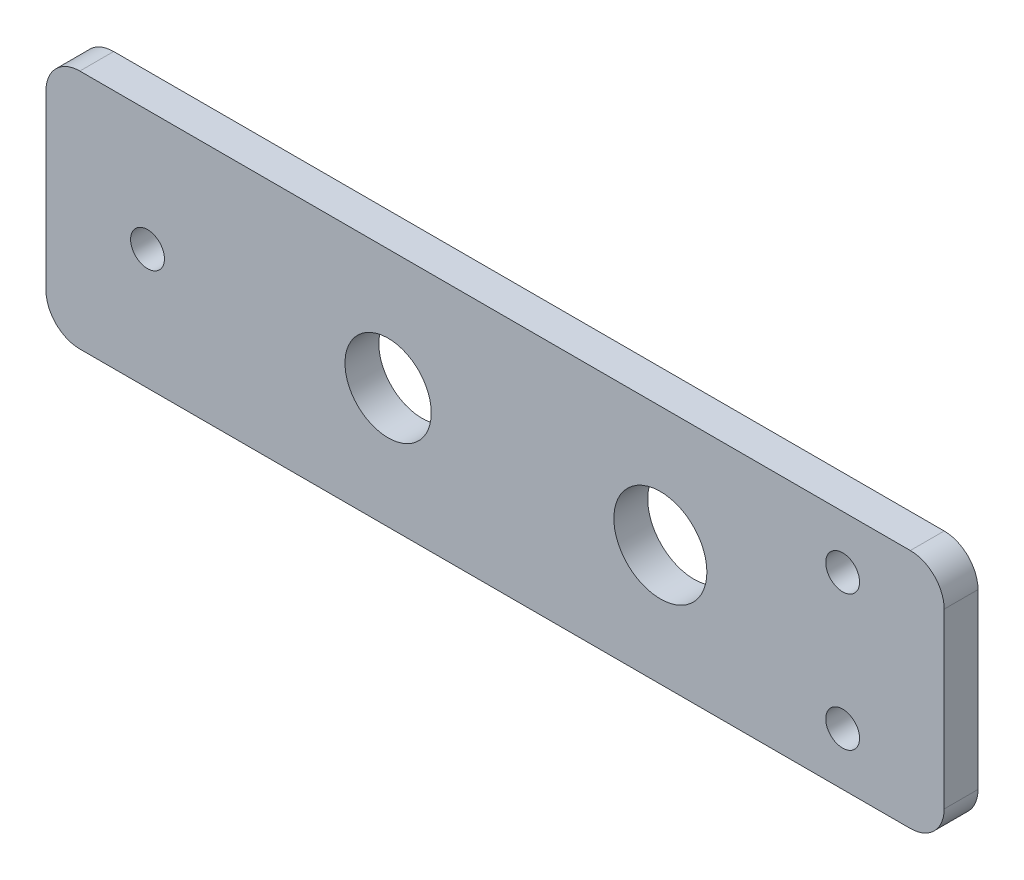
ISO-10303-21;
HEADER;
FILE_DESCRIPTION(('STEP AP214'),'2;1');
FILE_NAME('part.step','',(''),(''),'','','');
FILE_SCHEMA(('AUTOMOTIVE_DESIGN { 1 0 10303 214 1 1 1 1 }'));
ENDSEC;
DATA;
#1=APPLICATION_CONTEXT('core data for automotive mechanical design processes');
#2=APPLICATION_PROTOCOL_DEFINITION('international standard','automotive_design',2000,#1);
#3=PRODUCT_CONTEXT('',#1,'mechanical');
#4=PRODUCT('Part','Part','',(#3));
#5=PRODUCT_RELATED_PRODUCT_CATEGORY('part','',(#4));
#6=PRODUCT_DEFINITION_FORMATION('','',#4);
#7=PRODUCT_DEFINITION_CONTEXT('part definition',#1,'design');
#8=PRODUCT_DEFINITION('design','',#6,#7);
#9=PRODUCT_DEFINITION_SHAPE('','',#8);
#10=(LENGTH_UNIT() NAMED_UNIT(*) SI_UNIT(.MILLI.,.METRE.));
#11=(NAMED_UNIT(*) PLANE_ANGLE_UNIT() SI_UNIT($,.RADIAN.));
#12=(NAMED_UNIT(*) SI_UNIT($,.STERADIAN.) SOLID_ANGLE_UNIT());
#13=UNCERTAINTY_MEASURE_WITH_UNIT(LENGTH_MEASURE(1.E-05),#10,'distance_accuracy_value','');
#14=(GEOMETRIC_REPRESENTATION_CONTEXT(3) GLOBAL_UNCERTAINTY_ASSIGNED_CONTEXT((#13)) GLOBAL_UNIT_ASSIGNED_CONTEXT((#10,
#11,#12)) REPRESENTATION_CONTEXT('',''));
#15=CARTESIAN_POINT('',(0.,0.,0.));
#16=DIRECTION('',(0.,0.,1.));
#17=DIRECTION('',(1.,0.,0.));
#18=AXIS2_PLACEMENT_3D('',#15,#16,#17);
#19=CARTESIAN_POINT('',(0.,0.,2.54));
#20=DIRECTION('',(0.,0.,-1.));
#21=DIRECTION('',(-1.,0.,0.));
#22=AXIS2_PLACEMENT_3D('',#19,#20,#21);
#23=PLANE('',#22);
#24=DIRECTION('',(1.,0.,0.));
#25=VECTOR('',#24,1.);
#26=CARTESIAN_POINT('',(21.3032407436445,-9.03586527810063,2.54));
#27=LINE('',#26,#25);
#28=CARTESIAN_POINT('',(-43.577750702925,-9.03586527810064,2.54));
#29=VERTEX_POINT('',#28);
#30=CARTESIAN_POINT('',(18.7632407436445,-9.03586527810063,2.54));
#31=VERTEX_POINT('',#30);
#32=EDGE_CURVE('E135',#29,#31,#27,.T.);
#33=ORIENTED_EDGE('',*,*,#32,.T.);
#34=CARTESIAN_POINT('',(18.7632407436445,-6.49586527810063,2.54));
#35=DIRECTION('',(0.,0.,-1.));
#36=DIRECTION('',(-1.,0.,0.));
#37=AXIS2_PLACEMENT_3D('',#34,#35,#36);
#38=CIRCLE('',#37,2.54);
#39=CARTESIAN_POINT('',(21.3032407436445,-6.49586527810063,2.54));
#40=VERTEX_POINT('',#39);
#41=EDGE_CURVE('E154',#31,#40,#38,.F.);
#42=ORIENTED_EDGE('',*,*,#41,.T.);
#43=DIRECTION('',(0.,1.,0.));
#44=VECTOR('',#43,1.);
#45=CARTESIAN_POINT('',(21.3032407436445,9.03586527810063,2.54));
#46=LINE('',#45,#44);
#47=CARTESIAN_POINT('',(21.3032407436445,6.49586527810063,2.54));
#48=VERTEX_POINT('',#47);
#49=EDGE_CURVE('E118',#40,#48,#46,.T.);
#50=ORIENTED_EDGE('',*,*,#49,.T.);
#51=CARTESIAN_POINT('',(18.7632407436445,6.49586527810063,2.54));
#52=DIRECTION('',(0.,0.,-1.));
#53=DIRECTION('',(-1.,0.,0.));
#54=AXIS2_PLACEMENT_3D('',#51,#52,#53);
#55=CIRCLE('',#54,2.54);
#56=CARTESIAN_POINT('',(18.7632407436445,9.03586527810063,2.54));
#57=VERTEX_POINT('',#56);
#58=EDGE_CURVE('E152',#48,#57,#55,.F.);
#59=ORIENTED_EDGE('',*,*,#58,.T.);
#60=DIRECTION('',(-1.,0.,0.));
#61=VECTOR('',#60,1.);
#62=CARTESIAN_POINT('',(21.3032407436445,9.03586527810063,2.54));
#63=LINE('',#62,#61);
#64=CARTESIAN_POINT('',(-43.577750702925,9.03586527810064,2.54));
#65=VERTEX_POINT('',#64);
#66=EDGE_CURVE('E174',#57,#65,#63,.T.);
#67=ORIENTED_EDGE('',*,*,#66,.T.);
#68=CARTESIAN_POINT('',(-43.577750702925,6.49586527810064,2.54));
#69=DIRECTION('',(0.,0.,-1.));
#70=DIRECTION('',(-1.,0.,0.));
#71=AXIS2_PLACEMENT_3D('',#68,#69,#70);
#72=CIRCLE('',#71,2.54);
#73=CARTESIAN_POINT('',(-46.117750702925,6.49586527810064,2.54));
#74=VERTEX_POINT('',#73);
#75=EDGE_CURVE('E53',#65,#74,#72,.F.);
#76=ORIENTED_EDGE('',*,*,#75,.T.);
#77=DIRECTION('',(0.,-1.,0.));
#78=VECTOR('',#77,1.);
#79=CARTESIAN_POINT('',(-46.117750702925,9.03586527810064,2.54));
#80=LINE('',#79,#78);
#81=CARTESIAN_POINT('',(-46.117750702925,-6.49586527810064,2.54));
#82=VERTEX_POINT('',#81);
#83=EDGE_CURVE('E164',#74,#82,#80,.T.);
#84=ORIENTED_EDGE('',*,*,#83,.T.);
#85=CARTESIAN_POINT('',(-43.577750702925,-6.49586527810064,2.54));
#86=DIRECTION('',(0.,0.,-1.));
#87=DIRECTION('',(-1.,0.,0.));
#88=AXIS2_PLACEMENT_3D('',#85,#86,#87);
#89=CIRCLE('',#88,2.54);
#90=EDGE_CURVE('E150',#82,#29,#89,.F.);
#91=ORIENTED_EDGE('',*,*,#90,.T.);
#92=EDGE_LOOP('',(#33,#42,#50,#59,#67,#76,#84,#91));
#93=FACE_BOUND('',#92,.T.);
#94=CARTESIAN_POINT('',(0.,0.,2.54));
#95=DIRECTION('',(0.,0.,1.));
#96=DIRECTION('',(1.,0.,0.));
#97=AXIS2_PLACEMENT_3D('',#94,#95,#96);
#98=CIRCLE('',#97,3.4925);
#99=CARTESIAN_POINT('',(3.4925,0.,2.54));
#100=VERTEX_POINT('',#99);
#101=EDGE_CURVE('E126',#100,#100,#98,.T.);
#102=ORIENTED_EDGE('',*,*,#101,.F.);
#103=EDGE_LOOP('',(#102));
#104=FACE_BOUND('',#103,.T.);
#105=CARTESIAN_POINT('',(-20.4370138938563,0.,2.54));
#106=DIRECTION('',(0.,0.,1.));
#107=DIRECTION('',(1.,0.,0.));
#108=AXIS2_PLACEMENT_3D('',#105,#106,#107);
#109=CIRCLE('',#108,3.23850000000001);
#110=CARTESIAN_POINT('',(-17.1985138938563,0.,2.54));
#111=VERTEX_POINT('',#110);
#112=EDGE_CURVE('E179',#111,#111,#109,.T.);
#113=ORIENTED_EDGE('',*,*,#112,.F.);
#114=EDGE_LOOP('',(#113));
#115=FACE_BOUND('',#114,.T.);
#116=CARTESIAN_POINT('',(-38.497750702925,0.,2.54));
#117=DIRECTION('',(0.,0.,1.));
#118=DIRECTION('',(1.,0.,0.));
#119=AXIS2_PLACEMENT_3D('',#116,#117,#118);
#120=CIRCLE('',#119,1.26999999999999);
#121=CARTESIAN_POINT('',(-37.227750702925,0.,2.54));
#122=VERTEX_POINT('',#121);
#123=EDGE_CURVE('E184',#122,#122,#120,.T.);
#124=ORIENTED_EDGE('',*,*,#123,.F.);
#125=EDGE_LOOP('',(#124));
#126=FACE_BOUND('',#125,.T.);
#127=CARTESIAN_POINT('',(13.6832407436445,5.08,2.54));
#128=DIRECTION('',(0.,0.,1.));
#129=DIRECTION('',(1.,0.,0.));
#130=AXIS2_PLACEMENT_3D('',#127,#128,#129);
#131=CIRCLE('',#130,1.27000000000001);
#132=CARTESIAN_POINT('',(14.9532407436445,5.08,2.54));
#133=VERTEX_POINT('',#132);
#134=EDGE_CURVE('E190',#133,#133,#131,.T.);
#135=ORIENTED_EDGE('',*,*,#134,.F.);
#136=EDGE_LOOP('',(#135));
#137=FACE_BOUND('',#136,.T.);
#138=CARTESIAN_POINT('',(13.6832407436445,-5.08,2.54));
#139=DIRECTION('',(0.,0.,1.));
#140=DIRECTION('',(1.,0.,0.));
#141=AXIS2_PLACEMENT_3D('',#138,#139,#140);
#142=CIRCLE('',#141,1.27000000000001);
#143=CARTESIAN_POINT('',(14.9532407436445,-5.08,2.54));
#144=VERTEX_POINT('',#143);
#145=EDGE_CURVE('E196',#144,#144,#142,.T.);
#146=ORIENTED_EDGE('',*,*,#145,.F.);
#147=EDGE_LOOP('',(#146));
#148=FACE_BOUND('',#147,.T.);
#149=ADVANCED_FACE('F33',(#93,#104,#115,#126,#137,#148),#23,.F.);
#150=CARTESIAN_POINT('',(0.,0.,0.));
#151=DIRECTION('',(0.,0.,-1.));
#152=DIRECTION('',(-1.,0.,0.));
#153=AXIS2_PLACEMENT_3D('',#150,#151,#152);
#154=PLANE('',#153);
#155=CARTESIAN_POINT('',(13.6832407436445,5.08,0.));
#156=DIRECTION('',(0.,0.,1.));
#157=DIRECTION('',(1.,0.,0.));
#158=AXIS2_PLACEMENT_3D('',#155,#156,#157);
#159=CIRCLE('',#158,1.27000000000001);
#160=CARTESIAN_POINT('',(14.9532407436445,5.08,0.));
#161=VERTEX_POINT('',#160);
#162=EDGE_CURVE('E193',#161,#161,#159,.T.);
#163=ORIENTED_EDGE('',*,*,#162,.T.);
#164=EDGE_LOOP('',(#163));
#165=FACE_BOUND('',#164,.T.);
#166=CARTESIAN_POINT('',(-20.4370138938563,0.,0.));
#167=DIRECTION('',(0.,0.,1.));
#168=DIRECTION('',(1.,0.,0.));
#169=AXIS2_PLACEMENT_3D('',#166,#167,#168);
#170=CIRCLE('',#169,3.23850000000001);
#171=CARTESIAN_POINT('',(-17.1985138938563,0.,0.));
#172=VERTEX_POINT('',#171);
#173=EDGE_CURVE('E181',#172,#172,#170,.T.);
#174=ORIENTED_EDGE('',*,*,#173,.T.);
#175=EDGE_LOOP('',(#174));
#176=FACE_BOUND('',#175,.T.);
#177=DIRECTION('',(0.,1.,0.));
#178=VECTOR('',#177,1.);
#179=CARTESIAN_POINT('',(21.3032407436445,9.03586527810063,0.));
#180=LINE('',#179,#178);
#181=CARTESIAN_POINT('',(21.3032407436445,-6.49586527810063,0.));
#182=VERTEX_POINT('',#181);
#183=CARTESIAN_POINT('',(21.3032407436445,6.49586527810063,0.));
#184=VERTEX_POINT('',#183);
#185=EDGE_CURVE('E115',#182,#184,#180,.T.);
#186=ORIENTED_EDGE('',*,*,#185,.F.);
#187=CARTESIAN_POINT('',(18.7632407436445,-6.49586527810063,0.));
#188=DIRECTION('',(0.,0.,-1.));
#189=DIRECTION('',(-1.,0.,0.));
#190=AXIS2_PLACEMENT_3D('',#187,#188,#189);
#191=CIRCLE('',#190,2.54);
#192=CARTESIAN_POINT('',(18.7632407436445,-9.03586527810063,0.));
#193=VERTEX_POINT('',#192);
#194=EDGE_CURVE('E98',#182,#193,#191,.T.);
#195=ORIENTED_EDGE('',*,*,#194,.T.);
#196=DIRECTION('',(1.,0.,0.));
#197=VECTOR('',#196,1.);
#198=CARTESIAN_POINT('',(21.3032407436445,-9.03586527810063,0.));
#199=LINE('',#198,#197);
#200=CARTESIAN_POINT('',(-43.577750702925,-9.03586527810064,0.));
#201=VERTEX_POINT('',#200);
#202=EDGE_CURVE('E139',#201,#193,#199,.T.);
#203=ORIENTED_EDGE('',*,*,#202,.F.);
#204=CARTESIAN_POINT('',(-43.577750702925,-6.49586527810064,0.));
#205=DIRECTION('',(0.,0.,-1.));
#206=DIRECTION('',(-1.,0.,0.));
#207=AXIS2_PLACEMENT_3D('',#204,#205,#206);
#208=CIRCLE('',#207,2.54);
#209=CARTESIAN_POINT('',(-46.117750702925,-6.49586527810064,0.));
#210=VERTEX_POINT('',#209);
#211=EDGE_CURVE('E143',#201,#210,#208,.T.);
#212=ORIENTED_EDGE('',*,*,#211,.T.);
#213=DIRECTION('',(0.,-1.,0.));
#214=VECTOR('',#213,1.);
#215=CARTESIAN_POINT('',(-46.117750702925,9.03586527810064,0.));
#216=LINE('',#215,#214);
#217=CARTESIAN_POINT('',(-46.117750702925,6.49586527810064,0.));
#218=VERTEX_POINT('',#217);
#219=EDGE_CURVE('E129',#218,#210,#216,.T.);
#220=ORIENTED_EDGE('',*,*,#219,.F.);
#221=CARTESIAN_POINT('',(-43.577750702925,6.49586527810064,0.));
#222=DIRECTION('',(0.,0.,-1.));
#223=DIRECTION('',(-1.,0.,0.));
#224=AXIS2_PLACEMENT_3D('',#221,#222,#223);
#225=CIRCLE('',#224,2.54);
#226=CARTESIAN_POINT('',(-43.577750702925,9.03586527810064,0.));
#227=VERTEX_POINT('',#226);
#228=EDGE_CURVE('E119',#218,#227,#225,.T.);
#229=ORIENTED_EDGE('',*,*,#228,.T.);
#230=DIRECTION('',(-1.,0.,0.));
#231=VECTOR('',#230,1.);
#232=CARTESIAN_POINT('',(21.3032407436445,9.03586527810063,0.));
#233=LINE('',#232,#231);
#234=CARTESIAN_POINT('',(18.7632407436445,9.03586527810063,0.));
#235=VERTEX_POINT('',#234);
#236=EDGE_CURVE('E125',#235,#227,#233,.T.);
#237=ORIENTED_EDGE('',*,*,#236,.F.);
#238=CARTESIAN_POINT('',(18.7632407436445,6.49586527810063,0.));
#239=DIRECTION('',(0.,0.,-1.));
#240=DIRECTION('',(-1.,0.,0.));
#241=AXIS2_PLACEMENT_3D('',#238,#239,#240);
#242=CIRCLE('',#241,2.54);
#243=EDGE_CURVE('E109',#235,#184,#242,.T.);
#244=ORIENTED_EDGE('',*,*,#243,.T.);
#245=EDGE_LOOP('',(#186,#195,#203,#212,#220,#229,#237,#244));
#246=FACE_BOUND('',#245,.T.);
#247=CARTESIAN_POINT('',(0.,0.,0.));
#248=DIRECTION('',(0.,0.,1.));
#249=DIRECTION('',(1.,0.,0.));
#250=AXIS2_PLACEMENT_3D('',#247,#248,#249);
#251=CIRCLE('',#250,3.4925);
#252=CARTESIAN_POINT('',(3.4925,0.,0.));
#253=VERTEX_POINT('',#252);
#254=EDGE_CURVE('E132',#253,#253,#251,.T.);
#255=ORIENTED_EDGE('',*,*,#254,.T.);
#256=EDGE_LOOP('',(#255));
#257=FACE_BOUND('',#256,.T.);
#258=CARTESIAN_POINT('',(-38.497750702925,0.,0.));
#259=DIRECTION('',(0.,0.,1.));
#260=DIRECTION('',(1.,0.,0.));
#261=AXIS2_PLACEMENT_3D('',#258,#259,#260);
#262=CIRCLE('',#261,1.26999999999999);
#263=CARTESIAN_POINT('',(-37.227750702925,0.,0.));
#264=VERTEX_POINT('',#263);
#265=EDGE_CURVE('E187',#264,#264,#262,.T.);
#266=ORIENTED_EDGE('',*,*,#265,.T.);
#267=EDGE_LOOP('',(#266));
#268=FACE_BOUND('',#267,.T.);
#269=CARTESIAN_POINT('',(13.6832407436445,-5.08,0.));
#270=DIRECTION('',(0.,0.,1.));
#271=DIRECTION('',(1.,0.,0.));
#272=AXIS2_PLACEMENT_3D('',#269,#270,#271);
#273=CIRCLE('',#272,1.27000000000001);
#274=CARTESIAN_POINT('',(14.9532407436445,-5.08,0.));
#275=VERTEX_POINT('',#274);
#276=EDGE_CURVE('E199',#275,#275,#273,.T.);
#277=ORIENTED_EDGE('',*,*,#276,.T.);
#278=EDGE_LOOP('',(#277));
#279=FACE_BOUND('',#278,.T.);
#280=ADVANCED_FACE('F122',(#165,#176,#246,#257,#268,#279),#154,.T.);
#281=CARTESIAN_POINT('',(21.3032407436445,9.03586527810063,2.54));
#282=DIRECTION('',(-1.,0.,0.));
#283=DIRECTION('',(0.,0.,1.));
#284=AXIS2_PLACEMENT_3D('',#281,#282,#283);
#285=PLANE('',#284);
#286=ORIENTED_EDGE('',*,*,#49,.F.);
#287=DIRECTION('',(0.,0.,-1.));
#288=VECTOR('',#287,1.);
#289=CARTESIAN_POINT('',(21.3032407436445,-6.49586527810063,2.54));
#290=LINE('',#289,#288);
#291=EDGE_CURVE('E102',#40,#182,#290,.T.);
#292=ORIENTED_EDGE('',*,*,#291,.T.);
#293=ORIENTED_EDGE('',*,*,#185,.T.);
#294=DIRECTION('',(0.,0.,-1.));
#295=VECTOR('',#294,1.);
#296=CARTESIAN_POINT('',(21.3032407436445,6.49586527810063,2.54));
#297=LINE('',#296,#295);
#298=EDGE_CURVE('E120',#184,#48,#297,.F.);
#299=ORIENTED_EDGE('',*,*,#298,.T.);
#300=EDGE_LOOP('',(#286,#292,#293,#299));
#301=FACE_BOUND('',#300,.T.);
#302=ADVANCED_FACE('F114',(#301),#285,.F.);
#303=CARTESIAN_POINT('',(21.3032407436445,9.03586527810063,2.54));
#304=DIRECTION('',(0.,-1.,0.));
#305=DIRECTION('',(1.,0.,0.));
#306=AXIS2_PLACEMENT_3D('',#303,#304,#305);
#307=PLANE('',#306);
#308=ORIENTED_EDGE('',*,*,#66,.F.);
#309=DIRECTION('',(0.,0.,-1.));
#310=VECTOR('',#309,1.);
#311=CARTESIAN_POINT('',(18.7632407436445,9.03586527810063,2.54));
#312=LINE('',#311,#310);
#313=EDGE_CURVE('E158',#57,#235,#312,.T.);
#314=ORIENTED_EDGE('',*,*,#313,.T.);
#315=ORIENTED_EDGE('',*,*,#236,.T.);
#316=DIRECTION('',(0.,0.,-1.));
#317=VECTOR('',#316,1.);
#318=CARTESIAN_POINT('',(-43.577750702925,9.03586527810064,2.54));
#319=LINE('',#318,#317);
#320=EDGE_CURVE('E156',#227,#65,#319,.F.);
#321=ORIENTED_EDGE('',*,*,#320,.T.);
#322=EDGE_LOOP('',(#308,#314,#315,#321));
#323=FACE_BOUND('',#322,.T.);
#324=ADVANCED_FACE('F224',(#323),#307,.F.);
#325=CARTESIAN_POINT('',(-46.117750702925,9.03586527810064,2.54));
#326=DIRECTION('',(1.,0.,0.));
#327=DIRECTION('',(0.,0.,-1.));
#328=AXIS2_PLACEMENT_3D('',#325,#326,#327);
#329=PLANE('',#328);
#330=ORIENTED_EDGE('',*,*,#219,.T.);
#331=DIRECTION('',(0.,0.,-1.));
#332=VECTOR('',#331,1.);
#333=CARTESIAN_POINT('',(-46.117750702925,-6.49586527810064,2.54));
#334=LINE('',#333,#332);
#335=EDGE_CURVE('E11',#210,#82,#334,.F.);
#336=ORIENTED_EDGE('',*,*,#335,.T.);
#337=ORIENTED_EDGE('',*,*,#83,.F.);
#338=DIRECTION('',(0.,0.,-1.));
#339=VECTOR('',#338,1.);
#340=CARTESIAN_POINT('',(-46.117750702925,6.49586527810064,2.54));
#341=LINE('',#340,#339);
#342=EDGE_CURVE('E41',#74,#218,#341,.T.);
#343=ORIENTED_EDGE('',*,*,#342,.T.);
#344=EDGE_LOOP('',(#330,#336,#337,#343));
#345=FACE_BOUND('',#344,.T.);
#346=ADVANCED_FACE('F163',(#345),#329,.F.);
#347=CARTESIAN_POINT('',(21.3032407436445,-9.03586527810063,2.54));
#348=DIRECTION('',(0.,1.,0.));
#349=DIRECTION('',(-1.,0.,0.));
#350=AXIS2_PLACEMENT_3D('',#347,#348,#349);
#351=PLANE('',#350);
#352=ORIENTED_EDGE('',*,*,#202,.T.);
#353=DIRECTION('',(0.,0.,-1.));
#354=VECTOR('',#353,1.);
#355=CARTESIAN_POINT('',(18.7632407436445,-9.03586527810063,2.54));
#356=LINE('',#355,#354);
#357=EDGE_CURVE('E103',#193,#31,#356,.F.);
#358=ORIENTED_EDGE('',*,*,#357,.T.);
#359=ORIENTED_EDGE('',*,*,#32,.F.);
#360=DIRECTION('',(0.,0.,-1.));
#361=VECTOR('',#360,1.);
#362=CARTESIAN_POINT('',(-43.577750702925,-9.03586527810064,2.54));
#363=LINE('',#362,#361);
#364=EDGE_CURVE('E108',#29,#201,#363,.T.);
#365=ORIENTED_EDGE('',*,*,#364,.T.);
#366=EDGE_LOOP('',(#352,#358,#359,#365));
#367=FACE_BOUND('',#366,.T.);
#368=ADVANCED_FACE('F172',(#367),#351,.F.);
#369=CARTESIAN_POINT('',(0.,0.,2.54));
#370=DIRECTION('',(0.,0.,-1.));
#371=DIRECTION('',(-1.,0.,0.));
#372=AXIS2_PLACEMENT_3D('',#369,#370,#371);
#373=CYLINDRICAL_SURFACE('',#372,3.4925);
#374=ORIENTED_EDGE('',*,*,#101,.T.);
#375=EDGE_LOOP('',(#374));
#376=FACE_BOUND('',#375,.T.);
#377=ORIENTED_EDGE('',*,*,#254,.F.);
#378=EDGE_LOOP('',(#377));
#379=FACE_BOUND('',#378,.T.);
#380=ADVANCED_FACE('F217',(#376,#379),#373,.F.);
#381=CARTESIAN_POINT('',(-20.4370138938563,0.,2.54));
#382=DIRECTION('',(0.,0.,-1.));
#383=DIRECTION('',(-1.,0.,0.));
#384=AXIS2_PLACEMENT_3D('',#381,#382,#383);
#385=CYLINDRICAL_SURFACE('',#384,3.23850000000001);
#386=ORIENTED_EDGE('',*,*,#112,.T.);
#387=EDGE_LOOP('',(#386));
#388=FACE_BOUND('',#387,.T.);
#389=ORIENTED_EDGE('',*,*,#173,.F.);
#390=EDGE_LOOP('',(#389));
#391=FACE_BOUND('',#390,.T.);
#392=ADVANCED_FACE('F325',(#388,#391),#385,.F.);
#393=CARTESIAN_POINT('',(-38.497750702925,0.,2.54));
#394=DIRECTION('',(0.,0.,-1.));
#395=DIRECTION('',(-1.,0.,0.));
#396=AXIS2_PLACEMENT_3D('',#393,#394,#395);
#397=CYLINDRICAL_SURFACE('',#396,1.26999999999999);
#398=ORIENTED_EDGE('',*,*,#123,.T.);
#399=EDGE_LOOP('',(#398));
#400=FACE_BOUND('',#399,.T.);
#401=ORIENTED_EDGE('',*,*,#265,.F.);
#402=EDGE_LOOP('',(#401));
#403=FACE_BOUND('',#402,.T.);
#404=ADVANCED_FACE('F315',(#400,#403),#397,.F.);
#405=CARTESIAN_POINT('',(13.6832407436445,5.08,2.54));
#406=DIRECTION('',(0.,0.,-1.));
#407=DIRECTION('',(-1.,0.,0.));
#408=AXIS2_PLACEMENT_3D('',#405,#406,#407);
#409=CYLINDRICAL_SURFACE('',#408,1.27000000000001);
#410=ORIENTED_EDGE('',*,*,#134,.T.);
#411=EDGE_LOOP('',(#410));
#412=FACE_BOUND('',#411,.T.);
#413=ORIENTED_EDGE('',*,*,#162,.F.);
#414=EDGE_LOOP('',(#413));
#415=FACE_BOUND('',#414,.T.);
#416=ADVANCED_FACE('F306',(#412,#415),#409,.F.);
#417=CARTESIAN_POINT('',(13.6832407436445,-5.08,2.54));
#418=DIRECTION('',(0.,0.,-1.));
#419=DIRECTION('',(-1.,0.,0.));
#420=AXIS2_PLACEMENT_3D('',#417,#418,#419);
#421=CYLINDRICAL_SURFACE('',#420,1.27000000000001);
#422=ORIENTED_EDGE('',*,*,#145,.T.);
#423=EDGE_LOOP('',(#422));
#424=FACE_BOUND('',#423,.T.);
#425=ORIENTED_EDGE('',*,*,#276,.F.);
#426=EDGE_LOOP('',(#425));
#427=FACE_BOUND('',#426,.T.);
#428=ADVANCED_FACE('F205',(#424,#427),#421,.F.);
#429=CARTESIAN_POINT('',(18.7632407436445,-6.49586527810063,2.54));
#430=DIRECTION('',(0.,0.,-1.));
#431=DIRECTION('',(-1.,0.,0.));
#432=AXIS2_PLACEMENT_3D('',#429,#430,#431);
#433=CYLINDRICAL_SURFACE('',#432,2.54);
#434=ORIENTED_EDGE('',*,*,#41,.F.);
#435=ORIENTED_EDGE('',*,*,#357,.F.);
#436=ORIENTED_EDGE('',*,*,#194,.F.);
#437=ORIENTED_EDGE('',*,*,#291,.F.);
#438=EDGE_LOOP('',(#434,#435,#436,#437));
#439=FACE_BOUND('',#438,.T.);
#440=ADVANCED_FACE('F101',(#439),#433,.T.);
#441=CARTESIAN_POINT('',(18.7632407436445,6.49586527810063,2.54));
#442=DIRECTION('',(0.,0.,-1.));
#443=DIRECTION('',(-1.,0.,0.));
#444=AXIS2_PLACEMENT_3D('',#441,#442,#443);
#445=CYLINDRICAL_SURFACE('',#444,2.54);
#446=ORIENTED_EDGE('',*,*,#58,.F.);
#447=ORIENTED_EDGE('',*,*,#298,.F.);
#448=ORIENTED_EDGE('',*,*,#243,.F.);
#449=ORIENTED_EDGE('',*,*,#313,.F.);
#450=EDGE_LOOP('',(#446,#447,#448,#449));
#451=FACE_BOUND('',#450,.T.);
#452=ADVANCED_FACE('F232',(#451),#445,.T.);
#453=CARTESIAN_POINT('',(-43.577750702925,-6.49586527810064,2.54));
#454=DIRECTION('',(0.,0.,-1.));
#455=DIRECTION('',(-1.,0.,0.));
#456=AXIS2_PLACEMENT_3D('',#453,#454,#455);
#457=CYLINDRICAL_SURFACE('',#456,2.54);
#458=ORIENTED_EDGE('',*,*,#90,.F.);
#459=ORIENTED_EDGE('',*,*,#335,.F.);
#460=ORIENTED_EDGE('',*,*,#211,.F.);
#461=ORIENTED_EDGE('',*,*,#364,.F.);
#462=EDGE_LOOP('',(#458,#459,#460,#461));
#463=FACE_BOUND('',#462,.T.);
#464=ADVANCED_FACE('F169',(#463),#457,.T.);
#465=CARTESIAN_POINT('',(-43.577750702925,6.49586527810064,2.54));
#466=DIRECTION('',(0.,0.,-1.));
#467=DIRECTION('',(-1.,0.,0.));
#468=AXIS2_PLACEMENT_3D('',#465,#466,#467);
#469=CYLINDRICAL_SURFACE('',#468,2.54);
#470=ORIENTED_EDGE('',*,*,#75,.F.);
#471=ORIENTED_EDGE('',*,*,#320,.F.);
#472=ORIENTED_EDGE('',*,*,#228,.F.);
#473=ORIENTED_EDGE('',*,*,#342,.F.);
#474=EDGE_LOOP('',(#470,#471,#472,#473));
#475=FACE_BOUND('',#474,.T.);
#476=ADVANCED_FACE('F35',(#475),#469,.T.);
#477=CLOSED_SHELL('',(#149,#280,#302,#324,#346,#368,#380,#392,#404,#416,#428,#440,#452,#464,#476));
#478=MANIFOLD_SOLID_BREP('B2',#477);
#479=ADVANCED_BREP_SHAPE_REPRESENTATION('',(#18,#478),#14);
#480=SHAPE_DEFINITION_REPRESENTATION(#9,#479);
ENDSEC;
END-ISO-10303-21;
